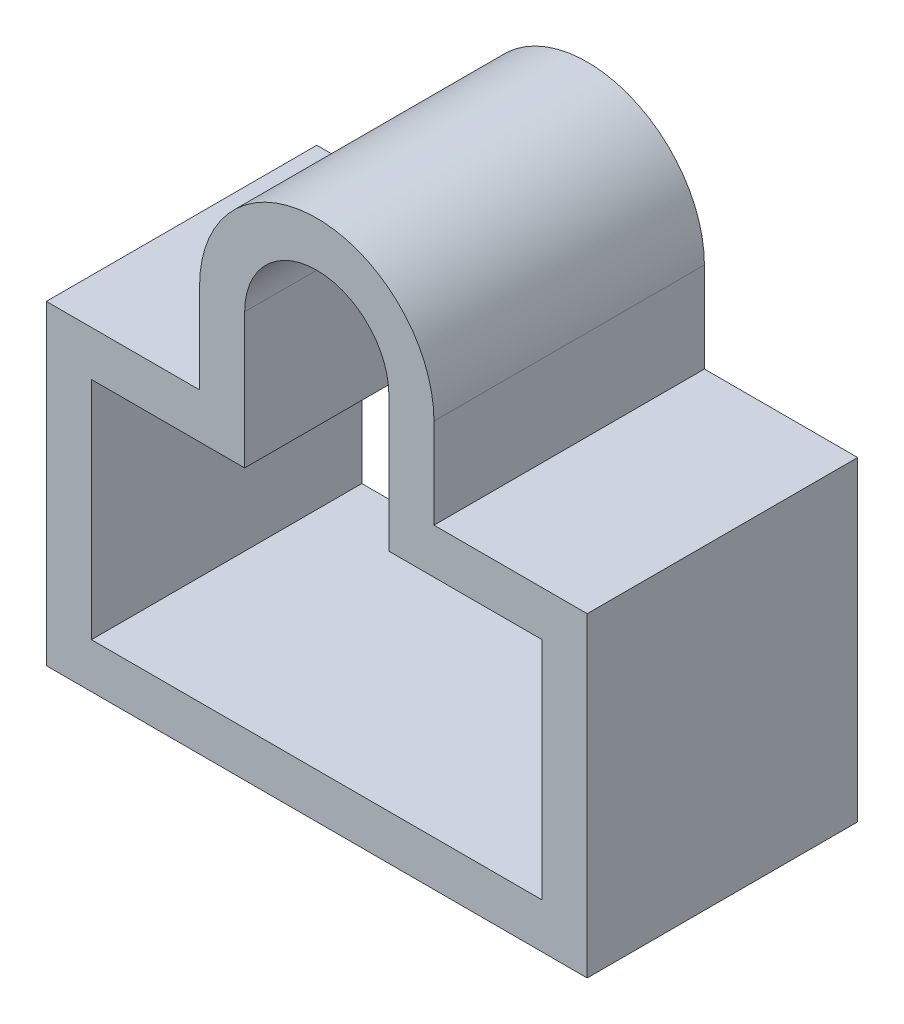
from build123d import *

# Parameters (mm, degrees)
EXTRUDE_THIN1_DEPTH = 30


with BuildPart() as part:
    # Sketch1 → Extrude-Thin1 (new body)
    with BuildSketch(Plane.XY):
        with BuildLine():
            Line((43, 45), (43, 35))
            Line((43, 35), (60, 35))
            Line((60, 35), (60, 0))
            Line((60, 0), (0, 0))
            Line((0, 0), (0, 35))
            Line((0, 35), (17, 35))
            Line((17, 35), (17, 45))
            ThreePointArc((17, 45), (30, 58), (43, 45))
        make_face()
        with BuildLine():
            Line((38, 45), (38, 30))
            Line((38, 30), (55, 30))
            Line((55, 30), (55, 5))
            Line((55, 5), (5, 5))
            Line((5, 5), (5, 30))
            Line((5, 30), (22, 30))
            Line((22, 30), (22, 45))
            ThreePointArc((22, 45), (30, 53), (38, 45))
        make_face(mode=Mode.SUBTRACT)
    extrude(amount=EXTRUDE_THIN1_DEPTH)


solid = part.part
